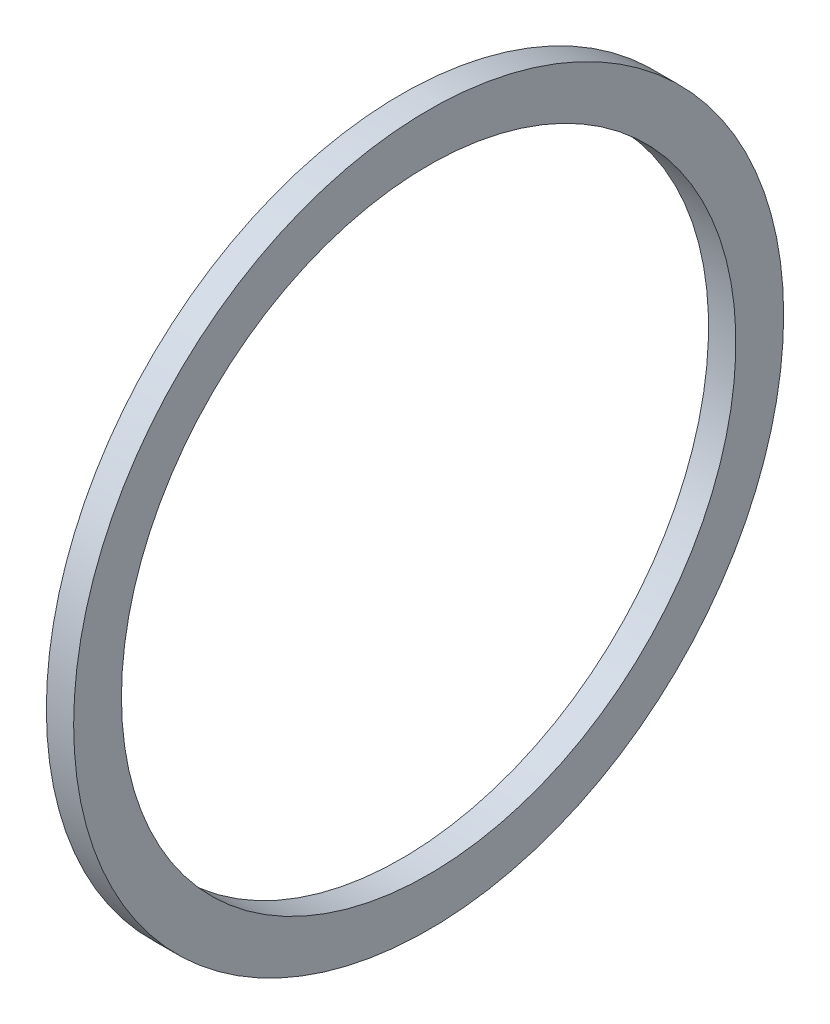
ISO-10303-21;
HEADER;
FILE_DESCRIPTION(('STEP AP214'),'2;1');
FILE_NAME('part.step','',(''),(''),'','','');
FILE_SCHEMA(('AUTOMOTIVE_DESIGN { 1 0 10303 214 1 1 1 1 }'));
ENDSEC;
DATA;
#1=APPLICATION_CONTEXT('core data for automotive mechanical design processes');
#2=APPLICATION_PROTOCOL_DEFINITION('international standard','automotive_design',2000,#1);
#3=PRODUCT_CONTEXT('',#1,'mechanical');
#4=PRODUCT('Part','Part','',(#3));
#5=PRODUCT_RELATED_PRODUCT_CATEGORY('part','',(#4));
#6=PRODUCT_DEFINITION_FORMATION('','',#4);
#7=PRODUCT_DEFINITION_CONTEXT('part definition',#1,'design');
#8=PRODUCT_DEFINITION('design','',#6,#7);
#9=PRODUCT_DEFINITION_SHAPE('','',#8);
#10=(LENGTH_UNIT() NAMED_UNIT(*) SI_UNIT(.MILLI.,.METRE.));
#11=(NAMED_UNIT(*) PLANE_ANGLE_UNIT() SI_UNIT($,.RADIAN.));
#12=(NAMED_UNIT(*) SI_UNIT($,.STERADIAN.) SOLID_ANGLE_UNIT());
#13=UNCERTAINTY_MEASURE_WITH_UNIT(LENGTH_MEASURE(1.E-05),#10,'distance_accuracy_value','');
#14=(GEOMETRIC_REPRESENTATION_CONTEXT(3) GLOBAL_UNCERTAINTY_ASSIGNED_CONTEXT((#13)) GLOBAL_UNIT_ASSIGNED_CONTEXT((#10,
#11,#12)) REPRESENTATION_CONTEXT('',''));
#15=CARTESIAN_POINT('',(0.,0.,0.));
#16=DIRECTION('',(0.,0.,1.));
#17=DIRECTION('',(1.,0.,0.));
#18=AXIS2_PLACEMENT_3D('',#15,#16,#17);
#19=CARTESIAN_POINT('',(16.,26.,0.));
#20=DIRECTION('',(1.,0.,0.));
#21=DIRECTION('',(0.,0.,-1.));
#22=AXIS2_PLACEMENT_3D('',#19,#20,#21);
#23=PLANE('',#22);
#24=CARTESIAN_POINT('',(16.,0.,0.));
#25=DIRECTION('',(-1.,0.,0.));
#26=DIRECTION('',(0.,0.,1.));
#27=AXIS2_PLACEMENT_3D('',#24,#25,#26);
#28=CIRCLE('',#27,22.5);
#29=CARTESIAN_POINT('',(16.,0.,22.5));
#30=VERTEX_POINT('',#29);
#31=EDGE_CURVE('E10',#30,#30,#28,.T.);
#32=ORIENTED_EDGE('',*,*,#31,.F.);
#33=EDGE_LOOP('',(#32));
#34=FACE_BOUND('',#33,.T.);
#35=CARTESIAN_POINT('',(16.,0.,0.));
#36=DIRECTION('',(-1.,0.,0.));
#37=DIRECTION('',(0.,0.,1.));
#38=AXIS2_PLACEMENT_3D('',#35,#36,#37);
#39=CIRCLE('',#38,26.);
#40=CARTESIAN_POINT('',(16.,0.,26.));
#41=VERTEX_POINT('',#40);
#42=EDGE_CURVE('E380',#41,#41,#39,.T.);
#43=ORIENTED_EDGE('',*,*,#42,.T.);
#44=EDGE_LOOP('',(#43));
#45=FACE_BOUND('',#44,.T.);
#46=ADVANCED_FACE('F366',(#34,#45),#23,.F.);
#47=CARTESIAN_POINT('',(0.,0.,0.));
#48=DIRECTION('',(-1.,0.,0.));
#49=DIRECTION('',(0.,0.,1.));
#50=AXIS2_PLACEMENT_3D('',#47,#48,#49);
#51=CYLINDRICAL_SURFACE('',#50,22.5);
#52=CARTESIAN_POINT('',(18.,0.,0.));
#53=DIRECTION('',(-1.,0.,0.));
#54=DIRECTION('',(0.,0.,1.));
#55=AXIS2_PLACEMENT_3D('',#52,#53,#54);
#56=CIRCLE('',#55,22.5);
#57=CARTESIAN_POINT('',(18.,0.,22.5));
#58=VERTEX_POINT('',#57);
#59=EDGE_CURVE('E372',#58,#58,#56,.T.);
#60=ORIENTED_EDGE('',*,*,#59,.F.);
#61=EDGE_LOOP('',(#60));
#62=FACE_BOUND('',#61,.T.);
#63=ORIENTED_EDGE('',*,*,#31,.T.);
#64=EDGE_LOOP('',(#63));
#65=FACE_BOUND('',#64,.T.);
#66=ADVANCED_FACE('F395',(#62,#65),#51,.F.);
#67=CARTESIAN_POINT('',(18.,26.,0.));
#68=DIRECTION('',(-1.,0.,0.));
#69=DIRECTION('',(0.,0.,1.));
#70=AXIS2_PLACEMENT_3D('',#67,#68,#69);
#71=PLANE('',#70);
#72=CARTESIAN_POINT('',(18.,0.,0.));
#73=DIRECTION('',(-1.,0.,0.));
#74=DIRECTION('',(0.,0.,1.));
#75=AXIS2_PLACEMENT_3D('',#72,#73,#74);
#76=CIRCLE('',#75,26.);
#77=CARTESIAN_POINT('',(18.,0.,26.));
#78=VERTEX_POINT('',#77);
#79=EDGE_CURVE('E376',#78,#78,#76,.T.);
#80=ORIENTED_EDGE('',*,*,#79,.F.);
#81=EDGE_LOOP('',(#80));
#82=FACE_BOUND('',#81,.T.);
#83=ORIENTED_EDGE('',*,*,#59,.T.);
#84=EDGE_LOOP('',(#83));
#85=FACE_BOUND('',#84,.T.);
#86=ADVANCED_FACE('F390',(#82,#85),#71,.F.);
#87=CARTESIAN_POINT('',(0.,0.,0.));
#88=DIRECTION('',(-1.,0.,0.));
#89=DIRECTION('',(0.,0.,1.));
#90=AXIS2_PLACEMENT_3D('',#87,#88,#89);
#91=CYLINDRICAL_SURFACE('',#90,26.);
#92=ORIENTED_EDGE('',*,*,#42,.F.);
#93=EDGE_LOOP('',(#92));
#94=FACE_BOUND('',#93,.T.);
#95=ORIENTED_EDGE('',*,*,#79,.T.);
#96=EDGE_LOOP('',(#95));
#97=FACE_BOUND('',#96,.T.);
#98=ADVANCED_FACE('F387',(#94,#97),#91,.T.);
#99=CLOSED_SHELL('',(#46,#66,#86,#98));
#100=MANIFOLD_SOLID_BREP('B2',#99);
#101=ADVANCED_BREP_SHAPE_REPRESENTATION('',(#18,#100),#14);
#102=SHAPE_DEFINITION_REPRESENTATION(#9,#101);
ENDSEC;
END-ISO-10303-21;
